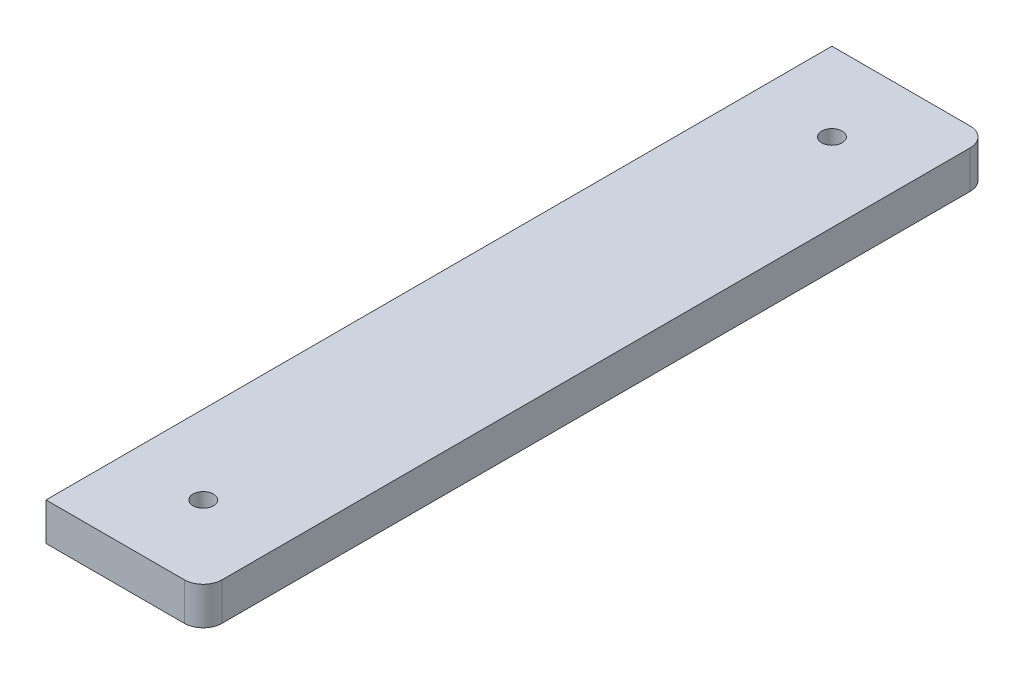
from build123d import *

# Parameters (mm, degrees)
SKETCH1_W           = 50
SKETCH1_H           = 250
BOSS_EXTRUDE1_DEPTH = 12
FILLET1_R           = 6
SKETCH2_R           = 3.25
CUT_EXTRUDE1_DEPTH  = 12


with BuildPart() as part:
    # Sketch1 → Boss-Extrude1 (new body)
    with BuildSketch(Plane(origin=(0, 0, 0), x_dir=(1, 0, 0), z_dir=(0, 1, 0))):
        with Locations((25, 125)):
            Rectangle(SKETCH1_W, SKETCH1_H)
    extrude(amount=BOSS_EXTRUDE1_DEPTH)

    # Fillet1
    fillet1_edges = [part.edges().sort_by_distance(p)[0] for p in [
        (50, 6, -250),
        (50, 6, 0),
    ]]
    fillet(fillet1_edges, radius=FILLET1_R)

    # Sketch2 → Cut-Extrude1 (cut)
    with BuildSketch(Plane(origin=(0, 12, 0), x_dir=(1, 0, 0), z_dir=(0, 1, 0))):
        with Locations(Location((25, 225, 0), (0, 0, 270))):
            Circle(SKETCH2_R)
        with Locations(Location((25, 25, 0), (0, 0, 270))):
            Circle(SKETCH2_R)
    extrude(amount=-CUT_EXTRUDE1_DEPTH, mode=Mode.SUBTRACT)


solid = part.part
